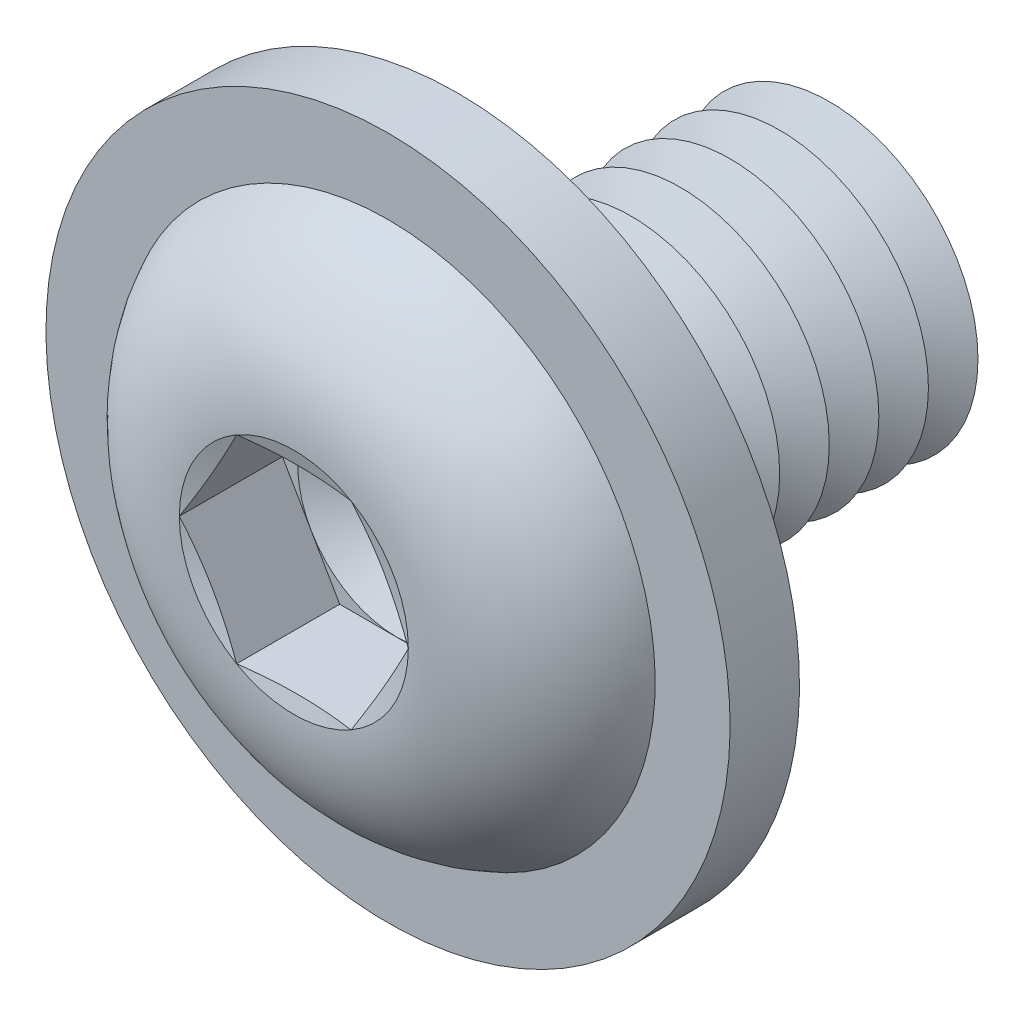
ISO-10303-21;
HEADER;
FILE_DESCRIPTION(('STEP AP214'),'2;1');
FILE_NAME('part.step','',(''),(''),'','','');
FILE_SCHEMA(('AUTOMOTIVE_DESIGN { 1 0 10303 214 1 1 1 1 }'));
ENDSEC;
DATA;
#1=APPLICATION_CONTEXT('core data for automotive mechanical design processes');
#2=APPLICATION_PROTOCOL_DEFINITION('international standard','automotive_design',2000,#1);
#3=PRODUCT_CONTEXT('',#1,'mechanical');
#4=PRODUCT('Part','Part','',(#3));
#5=PRODUCT_RELATED_PRODUCT_CATEGORY('part','',(#4));
#6=PRODUCT_DEFINITION_FORMATION('','',#4);
#7=PRODUCT_DEFINITION_CONTEXT('part definition',#1,'design');
#8=PRODUCT_DEFINITION('design','',#6,#7);
#9=PRODUCT_DEFINITION_SHAPE('','',#8);
#10=(LENGTH_UNIT() NAMED_UNIT(*) SI_UNIT(.MILLI.,.METRE.));
#11=(NAMED_UNIT(*) PLANE_ANGLE_UNIT() SI_UNIT($,.RADIAN.));
#12=(NAMED_UNIT(*) SI_UNIT($,.STERADIAN.) SOLID_ANGLE_UNIT());
#13=UNCERTAINTY_MEASURE_WITH_UNIT(LENGTH_MEASURE(1.E-05),#10,'distance_accuracy_value','');
#14=(GEOMETRIC_REPRESENTATION_CONTEXT(3) GLOBAL_UNCERTAINTY_ASSIGNED_CONTEXT((#13)) GLOBAL_UNIT_ASSIGNED_CONTEXT((#10,
#11,#12)) REPRESENTATION_CONTEXT('',''));
#15=CARTESIAN_POINT('',(0.,0.,0.));
#16=DIRECTION('',(0.,0.,1.));
#17=DIRECTION('',(1.,0.,0.));
#18=AXIS2_PLACEMENT_3D('',#15,#16,#17);
#19=CARTESIAN_POINT('',(0.,0.,-2.25));
#20=DIRECTION('',(0.,0.,1.));
#21=DIRECTION('',(1.,0.,0.));
#22=AXIS2_PLACEMENT_3D('',#19,#20,#21);
#23=CONICAL_SURFACE('',#22,1.5,1.0471975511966);
#24=CARTESIAN_POINT('',(0.,0.,-2.5));
#25=DIRECTION('',(0.,0.,1.));
#26=DIRECTION('',(1.,0.,0.));
#27=AXIS2_PLACEMENT_3D('',#24,#25,#26);
#28=CIRCLE('',#27,1.06698729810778);
#29=CARTESIAN_POINT('',(1.06698729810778,0.,-2.5));
#30=VERTEX_POINT('',#29);
#31=EDGE_CURVE('E274',#30,#30,#28,.T.);
#32=ORIENTED_EDGE('',*,*,#31,.T.);
#33=EDGE_LOOP('',(#32));
#34=FACE_BOUND('',#33,.T.);
#35=CARTESIAN_POINT('',(0.,0.,-2.25));
#36=DIRECTION('',(0.,0.,1.));
#37=DIRECTION('',(1.,0.,0.));
#38=AXIS2_PLACEMENT_3D('',#35,#36,#37);
#39=CIRCLE('',#38,1.5);
#40=CARTESIAN_POINT('',(1.5,0.,-2.25));
#41=VERTEX_POINT('',#40);
#42=EDGE_CURVE('E270',#41,#41,#39,.T.);
#43=ORIENTED_EDGE('',*,*,#42,.F.);
#44=EDGE_LOOP('',(#43));
#45=FACE_BOUND('',#44,.T.);
#46=ADVANCED_FACE('F39',(#34,#45),#23,.T.);
#47=CARTESIAN_POINT('',(0.,0.,-2.5));
#48=DIRECTION('',(0.,0.,-1.));
#49=DIRECTION('',(-1.,0.,0.));
#50=AXIS2_PLACEMENT_3D('',#47,#48,#49);
#51=CONICAL_SURFACE('',#50,1.06698729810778,1.0471975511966);
#52=CARTESIAN_POINT('',(0.,0.,-2.75));
#53=DIRECTION('',(0.,0.,1.));
#54=DIRECTION('',(1.,0.,0.));
#55=AXIS2_PLACEMENT_3D('',#52,#53,#54);
#56=CIRCLE('',#55,1.5);
#57=CARTESIAN_POINT('',(1.5,0.,-2.75));
#58=VERTEX_POINT('',#57);
#59=EDGE_CURVE('E278',#58,#58,#56,.T.);
#60=ORIENTED_EDGE('',*,*,#59,.T.);
#61=EDGE_LOOP('',(#60));
#62=FACE_BOUND('',#61,.T.);
#63=ORIENTED_EDGE('',*,*,#31,.F.);
#64=EDGE_LOOP('',(#63));
#65=FACE_BOUND('',#64,.T.);
#66=ADVANCED_FACE('F390',(#62,#65),#51,.T.);
#67=CARTESIAN_POINT('',(0.,1.5,-4.));
#68=DIRECTION('',(0.,0.,-1.));
#69=DIRECTION('',(-1.,0.,0.));
#70=AXIS2_PLACEMENT_3D('',#67,#68,#69);
#71=PLANE('',#70);
#72=CARTESIAN_POINT('',(0.,0.,-4.));
#73=DIRECTION('',(0.,0.,1.));
#74=DIRECTION('',(1.,0.,0.));
#75=AXIS2_PLACEMENT_3D('',#72,#73,#74);
#76=CIRCLE('',#75,1.06698729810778);
#77=CARTESIAN_POINT('',(1.06698729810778,0.,-4.));
#78=VERTEX_POINT('',#77);
#79=EDGE_CURVE('E297',#78,#78,#76,.T.);
#80=ORIENTED_EDGE('',*,*,#79,.F.);
#81=EDGE_LOOP('',(#80));
#82=FACE_BOUND('',#81,.T.);
#83=ADVANCED_FACE('F396',(#82),#71,.T.);
#84=CARTESIAN_POINT('',(0.,0.,-3.75));
#85=DIRECTION('',(0.,0.,1.));
#86=DIRECTION('',(1.,0.,0.));
#87=AXIS2_PLACEMENT_3D('',#84,#85,#86);
#88=CONICAL_SURFACE('',#87,1.5,1.0471975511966);
#89=ORIENTED_EDGE('',*,*,#79,.T.);
#90=EDGE_LOOP('',(#89));
#91=FACE_BOUND('',#90,.T.);
#92=CARTESIAN_POINT('',(0.,0.,-3.75));
#93=DIRECTION('',(0.,0.,1.));
#94=DIRECTION('',(1.,0.,0.));
#95=AXIS2_PLACEMENT_3D('',#92,#93,#94);
#96=CIRCLE('',#95,1.5);
#97=CARTESIAN_POINT('',(1.5,0.,-3.75));
#98=VERTEX_POINT('',#97);
#99=EDGE_CURVE('E293',#98,#98,#96,.T.);
#100=ORIENTED_EDGE('',*,*,#99,.F.);
#101=EDGE_LOOP('',(#100));
#102=FACE_BOUND('',#101,.T.);
#103=ADVANCED_FACE('F415',(#91,#102),#88,.T.);
#104=CARTESIAN_POINT('',(0.,0.,-3.5));
#105=DIRECTION('',(0.,0.,-1.));
#106=DIRECTION('',(-1.,0.,0.));
#107=AXIS2_PLACEMENT_3D('',#104,#105,#106);
#108=CONICAL_SURFACE('',#107,1.06698729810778,1.0471975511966);
#109=ORIENTED_EDGE('',*,*,#99,.T.);
#110=EDGE_LOOP('',(#109));
#111=FACE_BOUND('',#110,.T.);
#112=CARTESIAN_POINT('',(0.,0.,-3.5));
#113=DIRECTION('',(0.,0.,1.));
#114=DIRECTION('',(1.,0.,0.));
#115=AXIS2_PLACEMENT_3D('',#112,#113,#114);
#116=CIRCLE('',#115,1.06698729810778);
#117=CARTESIAN_POINT('',(1.06698729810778,0.,-3.5));
#118=VERTEX_POINT('',#117);
#119=EDGE_CURVE('E289',#118,#118,#116,.T.);
#120=ORIENTED_EDGE('',*,*,#119,.F.);
#121=EDGE_LOOP('',(#120));
#122=FACE_BOUND('',#121,.T.);
#123=ADVANCED_FACE('F412',(#111,#122),#108,.T.);
#124=CARTESIAN_POINT('',(0.,0.,-3.25));
#125=DIRECTION('',(0.,0.,1.));
#126=DIRECTION('',(1.,0.,0.));
#127=AXIS2_PLACEMENT_3D('',#124,#125,#126);
#128=CONICAL_SURFACE('',#127,1.5,1.0471975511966);
#129=ORIENTED_EDGE('',*,*,#119,.T.);
#130=EDGE_LOOP('',(#129));
#131=FACE_BOUND('',#130,.T.);
#132=CARTESIAN_POINT('',(0.,0.,-3.25));
#133=DIRECTION('',(0.,0.,1.));
#134=DIRECTION('',(1.,0.,0.));
#135=AXIS2_PLACEMENT_3D('',#132,#133,#134);
#136=CIRCLE('',#135,1.5);
#137=CARTESIAN_POINT('',(1.5,0.,-3.25));
#138=VERTEX_POINT('',#137);
#139=EDGE_CURVE('E285',#138,#138,#136,.T.);
#140=ORIENTED_EDGE('',*,*,#139,.F.);
#141=EDGE_LOOP('',(#140));
#142=FACE_BOUND('',#141,.T.);
#143=ADVANCED_FACE('F406',(#131,#142),#128,.T.);
#144=CARTESIAN_POINT('',(0.,0.,-3.));
#145=DIRECTION('',(0.,0.,-1.));
#146=DIRECTION('',(-1.,0.,0.));
#147=AXIS2_PLACEMENT_3D('',#144,#145,#146);
#148=CONICAL_SURFACE('',#147,1.06698729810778,1.0471975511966);
#149=ORIENTED_EDGE('',*,*,#139,.T.);
#150=EDGE_LOOP('',(#149));
#151=FACE_BOUND('',#150,.T.);
#152=CARTESIAN_POINT('',(0.,0.,-3.));
#153=DIRECTION('',(0.,0.,1.));
#154=DIRECTION('',(1.,0.,0.));
#155=AXIS2_PLACEMENT_3D('',#152,#153,#154);
#156=CIRCLE('',#155,1.06698729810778);
#157=CARTESIAN_POINT('',(1.06698729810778,0.,-3.));
#158=VERTEX_POINT('',#157);
#159=EDGE_CURVE('E281',#158,#158,#156,.T.);
#160=ORIENTED_EDGE('',*,*,#159,.F.);
#161=EDGE_LOOP('',(#160));
#162=FACE_BOUND('',#161,.T.);
#163=ADVANCED_FACE('F402',(#151,#162),#148,.T.);
#164=CARTESIAN_POINT('',(0.,0.,-2.75));
#165=DIRECTION('',(0.,0.,1.));
#166=DIRECTION('',(1.,0.,0.));
#167=AXIS2_PLACEMENT_3D('',#164,#165,#166);
#168=CONICAL_SURFACE('',#167,1.5,1.0471975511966);
#169=ORIENTED_EDGE('',*,*,#159,.T.);
#170=EDGE_LOOP('',(#169));
#171=FACE_BOUND('',#170,.T.);
#172=ORIENTED_EDGE('',*,*,#59,.F.);
#173=EDGE_LOOP('',(#172));
#174=FACE_BOUND('',#173,.T.);
#175=ADVANCED_FACE('F405',(#171,#174),#168,.T.);
#176=CARTESIAN_POINT('',(0.,0.,-1.75));
#177=DIRECTION('',(0.,0.,1.));
#178=DIRECTION('',(1.,0.,0.));
#179=AXIS2_PLACEMENT_3D('',#176,#177,#178);
#180=CONICAL_SURFACE('',#179,1.5,1.0471975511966);
#181=CARTESIAN_POINT('',(0.,0.,-2.));
#182=DIRECTION('',(0.,0.,1.));
#183=DIRECTION('',(1.,0.,0.));
#184=AXIS2_PLACEMENT_3D('',#181,#182,#183);
#185=CIRCLE('',#184,1.06698729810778);
#186=CARTESIAN_POINT('',(1.06698729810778,0.,-2.));
#187=VERTEX_POINT('',#186);
#188=EDGE_CURVE('E266',#187,#187,#185,.T.);
#189=ORIENTED_EDGE('',*,*,#188,.T.);
#190=EDGE_LOOP('',(#189));
#191=FACE_BOUND('',#190,.T.);
#192=CARTESIAN_POINT('',(0.,0.,-1.75));
#193=DIRECTION('',(0.,0.,1.));
#194=DIRECTION('',(1.,0.,0.));
#195=AXIS2_PLACEMENT_3D('',#192,#193,#194);
#196=CIRCLE('',#195,1.5);
#197=CARTESIAN_POINT('',(1.5,0.,-1.75));
#198=VERTEX_POINT('',#197);
#199=EDGE_CURVE('E262',#198,#198,#196,.T.);
#200=ORIENTED_EDGE('',*,*,#199,.F.);
#201=EDGE_LOOP('',(#200));
#202=FACE_BOUND('',#201,.T.);
#203=ADVANCED_FACE('F410',(#191,#202),#180,.T.);
#204=CARTESIAN_POINT('',(0.,0.,-2.));
#205=DIRECTION('',(0.,0.,-1.));
#206=DIRECTION('',(-1.,0.,0.));
#207=AXIS2_PLACEMENT_3D('',#204,#205,#206);
#208=CONICAL_SURFACE('',#207,1.06698729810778,1.0471975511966);
#209=ORIENTED_EDGE('',*,*,#42,.T.);
#210=EDGE_LOOP('',(#209));
#211=FACE_BOUND('',#210,.T.);
#212=ORIENTED_EDGE('',*,*,#188,.F.);
#213=EDGE_LOOP('',(#212));
#214=FACE_BOUND('',#213,.T.);
#215=ADVANCED_FACE('F461',(#211,#214),#208,.T.);
#216=CARTESIAN_POINT('',(0.,0.,-1.25));
#217=DIRECTION('',(0.,0.,1.));
#218=DIRECTION('',(1.,0.,0.));
#219=AXIS2_PLACEMENT_3D('',#216,#217,#218);
#220=CONICAL_SURFACE('',#219,1.5,1.0471975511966);
#221=CARTESIAN_POINT('',(0.,0.,-1.5));
#222=DIRECTION('',(0.,0.,1.));
#223=DIRECTION('',(1.,0.,0.));
#224=AXIS2_PLACEMENT_3D('',#221,#222,#223);
#225=CIRCLE('',#224,1.06698729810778);
#226=CARTESIAN_POINT('',(1.06698729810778,0.,-1.5));
#227=VERTEX_POINT('',#226);
#228=EDGE_CURVE('E258',#227,#227,#225,.T.);
#229=ORIENTED_EDGE('',*,*,#228,.T.);
#230=EDGE_LOOP('',(#229));
#231=FACE_BOUND('',#230,.T.);
#232=CARTESIAN_POINT('',(0.,0.,-1.25));
#233=DIRECTION('',(0.,0.,1.));
#234=DIRECTION('',(1.,0.,0.));
#235=AXIS2_PLACEMENT_3D('',#232,#233,#234);
#236=CIRCLE('',#235,1.5);
#237=CARTESIAN_POINT('',(1.5,0.,-1.25));
#238=VERTEX_POINT('',#237);
#239=EDGE_CURVE('E254',#238,#238,#236,.T.);
#240=ORIENTED_EDGE('',*,*,#239,.F.);
#241=EDGE_LOOP('',(#240));
#242=FACE_BOUND('',#241,.T.);
#243=ADVANCED_FACE('F467',(#231,#242),#220,.T.);
#244=CARTESIAN_POINT('',(0.,0.,-1.5));
#245=DIRECTION('',(0.,0.,-1.));
#246=DIRECTION('',(-1.,0.,0.));
#247=AXIS2_PLACEMENT_3D('',#244,#245,#246);
#248=CONICAL_SURFACE('',#247,1.06698729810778,1.0471975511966);
#249=ORIENTED_EDGE('',*,*,#199,.T.);
#250=EDGE_LOOP('',(#249));
#251=FACE_BOUND('',#250,.T.);
#252=ORIENTED_EDGE('',*,*,#228,.F.);
#253=EDGE_LOOP('',(#252));
#254=FACE_BOUND('',#253,.T.);
#255=ADVANCED_FACE('F474',(#251,#254),#248,.T.);
#256=CARTESIAN_POINT('',(0.,0.,-0.749999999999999));
#257=DIRECTION('',(0.,0.,1.));
#258=DIRECTION('',(1.,0.,0.));
#259=AXIS2_PLACEMENT_3D('',#256,#257,#258);
#260=CONICAL_SURFACE('',#259,1.5,1.0471975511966);
#261=CARTESIAN_POINT('',(0.,0.,-0.999999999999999));
#262=DIRECTION('',(0.,0.,1.));
#263=DIRECTION('',(1.,0.,0.));
#264=AXIS2_PLACEMENT_3D('',#261,#262,#263);
#265=CIRCLE('',#264,1.06698729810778);
#266=CARTESIAN_POINT('',(1.06698729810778,0.,-0.999999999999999));
#267=VERTEX_POINT('',#266);
#268=EDGE_CURVE('E250',#267,#267,#265,.T.);
#269=ORIENTED_EDGE('',*,*,#268,.T.);
#270=EDGE_LOOP('',(#269));
#271=FACE_BOUND('',#270,.T.);
#272=CARTESIAN_POINT('',(0.,0.,-0.749999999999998));
#273=DIRECTION('',(0.,0.,1.));
#274=DIRECTION('',(1.,0.,0.));
#275=AXIS2_PLACEMENT_3D('',#272,#273,#274);
#276=CIRCLE('',#275,1.5);
#277=CARTESIAN_POINT('',(1.5,0.,-0.749999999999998));
#278=VERTEX_POINT('',#277);
#279=EDGE_CURVE('E242',#278,#278,#276,.T.);
#280=ORIENTED_EDGE('',*,*,#279,.F.);
#281=EDGE_LOOP('',(#280));
#282=FACE_BOUND('',#281,.T.);
#283=ADVANCED_FACE('F481',(#271,#282),#260,.T.);
#284=CARTESIAN_POINT('',(0.,0.,-0.999999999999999));
#285=DIRECTION('',(0.,0.,-1.));
#286=DIRECTION('',(-1.,0.,0.));
#287=AXIS2_PLACEMENT_3D('',#284,#285,#286);
#288=CONICAL_SURFACE('',#287,1.06698729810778,1.0471975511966);
#289=ORIENTED_EDGE('',*,*,#239,.T.);
#290=EDGE_LOOP('',(#289));
#291=FACE_BOUND('',#290,.T.);
#292=ORIENTED_EDGE('',*,*,#268,.F.);
#293=EDGE_LOOP('',(#292));
#294=FACE_BOUND('',#293,.T.);
#295=ADVANCED_FACE('F488',(#291,#294),#288,.T.);
#296=CARTESIAN_POINT('',(0.,0.,-0.249999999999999));
#297=DIRECTION('',(0.,0.,1.));
#298=DIRECTION('',(1.,0.,0.));
#299=AXIS2_PLACEMENT_3D('',#296,#297,#298);
#300=CONICAL_SURFACE('',#299,1.5,1.0471975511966);
#301=CARTESIAN_POINT('',(0.,0.,-0.499999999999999));
#302=DIRECTION('',(0.,0.,1.));
#303=DIRECTION('',(1.,0.,0.));
#304=AXIS2_PLACEMENT_3D('',#301,#302,#303);
#305=CIRCLE('',#304,1.06698729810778);
#306=CARTESIAN_POINT('',(1.06698729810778,0.,-0.499999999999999));
#307=VERTEX_POINT('',#306);
#308=EDGE_CURVE('E231',#307,#307,#305,.T.);
#309=ORIENTED_EDGE('',*,*,#308,.T.);
#310=EDGE_LOOP('',(#309));
#311=FACE_BOUND('',#310,.T.);
#312=CARTESIAN_POINT('',(0.,0.,-0.249999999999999));
#313=DIRECTION('',(0.,0.,1.));
#314=DIRECTION('',(1.,0.,0.));
#315=AXIS2_PLACEMENT_3D('',#312,#313,#314);
#316=CIRCLE('',#315,1.5);
#317=CARTESIAN_POINT('',(1.5,0.,-0.249999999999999));
#318=VERTEX_POINT('',#317);
#319=EDGE_CURVE('E246',#318,#318,#316,.T.);
#320=ORIENTED_EDGE('',*,*,#319,.F.);
#321=EDGE_LOOP('',(#320));
#322=FACE_BOUND('',#321,.T.);
#323=ADVANCED_FACE('F495',(#311,#322),#300,.T.);
#324=CARTESIAN_POINT('',(0.,0.,-0.499999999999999));
#325=DIRECTION('',(0.,0.,-1.));
#326=DIRECTION('',(-1.,0.,0.));
#327=AXIS2_PLACEMENT_3D('',#324,#325,#326);
#328=CONICAL_SURFACE('',#327,1.06698729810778,1.0471975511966);
#329=ORIENTED_EDGE('',*,*,#279,.T.);
#330=EDGE_LOOP('',(#329));
#331=FACE_BOUND('',#330,.T.);
#332=ORIENTED_EDGE('',*,*,#308,.F.);
#333=EDGE_LOOP('',(#332));
#334=FACE_BOUND('',#333,.T.);
#335=ADVANCED_FACE('F220',(#331,#334),#328,.T.);
#336=CARTESIAN_POINT('',(0.,1.5,0.));
#337=DIRECTION('',(0.,0.,-1.));
#338=DIRECTION('',(-1.,0.,0.));
#339=AXIS2_PLACEMENT_3D('',#336,#337,#338);
#340=PLANE('',#339);
#341=CARTESIAN_POINT('',(0.,0.,0.));
#342=DIRECTION('',(0.,0.,-1.));
#343=DIRECTION('',(-1.,0.,0.));
#344=AXIS2_PLACEMENT_3D('',#341,#342,#343);
#345=CIRCLE('',#344,1.75);
#346=CARTESIAN_POINT('',(-1.75,0.,0.));
#347=VERTEX_POINT('',#346);
#348=EDGE_CURVE('E306',#347,#347,#345,.F.);
#349=ORIENTED_EDGE('',*,*,#348,.T.);
#350=EDGE_LOOP('',(#349));
#351=FACE_BOUND('',#350,.T.);
#352=CARTESIAN_POINT('',(0.,0.,0.));
#353=DIRECTION('',(0.,0.,-1.));
#354=DIRECTION('',(0.,1.,0.));
#355=AXIS2_PLACEMENT_3D('',#352,#353,#354);
#356=CIRCLE('',#355,3.45);
#357=CARTESIAN_POINT('',(0.,3.45,0.));
#358=VERTEX_POINT('',#357);
#359=EDGE_CURVE('E791',#358,#358,#356,.T.);
#360=ORIENTED_EDGE('',*,*,#359,.T.);
#361=EDGE_LOOP('',(#360));
#362=FACE_BOUND('',#361,.T.);
#363=ADVANCED_FACE('F507',(#351,#362),#340,.T.);
#364=CARTESIAN_POINT('',(0.,0.,-0.25));
#365=DIRECTION('',(0.,0.,-1.));
#366=DIRECTION('',(-1.,0.,0.));
#367=AXIS2_PLACEMENT_3D('',#364,#365,#366);
#368=TOROIDAL_SURFACE('',#367,1.75,0.25);
#369=ORIENTED_EDGE('',*,*,#348,.F.);
#370=EDGE_LOOP('',(#369));
#371=FACE_BOUND('',#370,.T.);
#372=ORIENTED_EDGE('',*,*,#319,.T.);
#373=EDGE_LOOP('',(#372));
#374=FACE_BOUND('',#373,.T.);
#375=ADVANCED_FACE('F41',(#371,#374),#368,.F.);
#376=CARTESIAN_POINT('',(0.,0.,0.7));
#377=DIRECTION('',(0.,0.,-1.));
#378=DIRECTION('',(0.,1.,0.));
#379=AXIS2_PLACEMENT_3D('',#376,#377,#378);
#380=CYLINDRICAL_SURFACE('',#379,3.45);
#381=CARTESIAN_POINT('',(0.,0.,0.7));
#382=DIRECTION('',(0.,0.,-1.));
#383=DIRECTION('',(0.,1.,0.));
#384=AXIS2_PLACEMENT_3D('',#381,#382,#383);
#385=CIRCLE('',#384,3.45);
#386=CARTESIAN_POINT('',(0.,3.45,0.7));
#387=VERTEX_POINT('',#386);
#388=EDGE_CURVE('E789',#387,#387,#385,.T.);
#389=ORIENTED_EDGE('',*,*,#388,.T.);
#390=EDGE_LOOP('',(#389));
#391=FACE_BOUND('',#390,.T.);
#392=ORIENTED_EDGE('',*,*,#359,.F.);
#393=EDGE_LOOP('',(#392));
#394=FACE_BOUND('',#393,.T.);
#395=ADVANCED_FACE('F518',(#391,#394),#380,.T.);
#396=CARTESIAN_POINT('',(0.,0.,0.7));
#397=DIRECTION('',(0.,0.,-1.));
#398=DIRECTION('',(0.,1.,0.));
#399=AXIS2_PLACEMENT_3D('',#396,#397,#398);
#400=PLANE('',#399);
#401=CARTESIAN_POINT('',(0.,0.,0.7));
#402=DIRECTION('',(0.,0.,-1.));
#403=DIRECTION('',(0.,1.,0.));
#404=AXIS2_PLACEMENT_3D('',#401,#402,#403);
#405=CIRCLE('',#404,2.69421838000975);
#406=CARTESIAN_POINT('',(0.,2.69421838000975,0.7));
#407=VERTEX_POINT('',#406);
#408=EDGE_CURVE('E43',#407,#407,#405,.F.);
#409=ORIENTED_EDGE('',*,*,#408,.F.);
#410=EDGE_LOOP('',(#409));
#411=FACE_BOUND('',#410,.T.);
#412=ORIENTED_EDGE('',*,*,#388,.F.);
#413=EDGE_LOOP('',(#412));
#414=FACE_BOUND('',#413,.T.);
#415=ADVANCED_FACE('F117',(#411,#414),#400,.F.);
#416=CARTESIAN_POINT('',(0.,0.,0.609999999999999));
#417=DIRECTION('',(0.,0.,1.));
#418=DIRECTION('',(1.,0.,0.));
#419=AXIS2_PLACEMENT_3D('',#416,#417,#418);
#420=CONICAL_SURFACE('',#419,0.99999953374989,1.0471975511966);
#421=CARTESIAN_POINT('',(0.,0.,0.0326500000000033));
#422=VERTEX_POINT('',#421);
#423=VERTEX_LOOP('',#422);
#424=FACE_BOUND('',#423,.T.);
#425=CARTESIAN_POINT('',(0.,0.,0.609999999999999));
#426=DIRECTION('',(0.,0.,1.));
#427=DIRECTION('',(1.,0.,0.));
#428=AXIS2_PLACEMENT_3D('',#425,#426,#427);
#429=CIRCLE('',#428,0.99999953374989);
#430=CARTESIAN_POINT('',(0.866024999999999,0.499999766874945,0.609999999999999));
#431=VERTEX_POINT('',#430);
#432=CARTESIAN_POINT('',(0.,0.99999953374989,0.609999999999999));
#433=VERTEX_POINT('',#432);
#434=EDGE_CURVE('E120',#431,#433,#429,.T.);
#435=ORIENTED_EDGE('',*,*,#434,.T.);
#436=CARTESIAN_POINT('',(0.,0.,0.609999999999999));
#437=DIRECTION('',(0.,0.,1.));
#438=DIRECTION('',(1.,0.,0.));
#439=AXIS2_PLACEMENT_3D('',#436,#437,#438);
#440=CIRCLE('',#439,0.99999953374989);
#441=CARTESIAN_POINT('',(-0.866024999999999,0.499999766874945,0.609999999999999));
#442=VERTEX_POINT('',#441);
#443=EDGE_CURVE('E11',#433,#442,#440,.T.);
#444=ORIENTED_EDGE('',*,*,#443,.T.);
#445=CARTESIAN_POINT('',(-0.866024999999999,-0.499999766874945,0.609999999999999));
#446=VERTEX_POINT('',#445);
#447=EDGE_CURVE('E49',#442,#446,#440,.T.);
#448=ORIENTED_EDGE('',*,*,#447,.T.);
#449=CARTESIAN_POINT('',(0.,-0.99999953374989,0.609999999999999));
#450=VERTEX_POINT('',#449);
#451=EDGE_CURVE('E312',#446,#450,#440,.T.);
#452=ORIENTED_EDGE('',*,*,#451,.T.);
#453=CARTESIAN_POINT('',(0.866024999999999,-0.499999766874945,0.609999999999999));
#454=VERTEX_POINT('',#453);
#455=EDGE_CURVE('E57',#450,#454,#440,.T.);
#456=ORIENTED_EDGE('',*,*,#455,.T.);
#457=EDGE_CURVE('E50',#454,#431,#440,.T.);
#458=ORIENTED_EDGE('',*,*,#457,.T.);
#459=EDGE_LOOP('',(#435,#444,#448,#452,#456,#458));
#460=FACE_BOUND('',#459,.T.);
#461=ADVANCED_FACE('F114',(#424,#460),#420,.F.);
#462=CARTESIAN_POINT('',(0.,0.,0.609999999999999));
#463=DIRECTION('',(0.,0.,1.));
#464=DIRECTION('',(1.,0.,0.));
#465=AXIS2_PLACEMENT_3D('',#462,#463,#464);
#466=PLANE('',#465);
#467=ORIENTED_EDGE('',*,*,#451,.F.);
#468=DIRECTION('',(0.5,-0.866025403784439,0.));
#469=VECTOR('',#468,1.);
#470=CARTESIAN_POINT('',(-1.1547,0.,0.609999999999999));
#471=LINE('',#470,#469);
#472=CARTESIAN_POINT('',(-0.577349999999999,-0.99999953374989,0.609999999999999));
#473=VERTEX_POINT('',#472);
#474=EDGE_CURVE('E154',#446,#473,#471,.T.);
#475=ORIENTED_EDGE('',*,*,#474,.T.);
#476=DIRECTION('',(1.,0.,0.));
#477=VECTOR('',#476,1.);
#478=CARTESIAN_POINT('',(-0.577349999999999,-0.99999953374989,0.609999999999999));
#479=LINE('',#478,#477);
#480=EDGE_CURVE('E160',#473,#450,#479,.T.);
#481=ORIENTED_EDGE('',*,*,#480,.T.);
#482=EDGE_LOOP('',(#467,#475,#481));
#483=FACE_BOUND('',#482,.T.);
#484=ADVANCED_FACE('F116',(#483),#466,.T.);
#485=ORIENTED_EDGE('',*,*,#455,.F.);
#486=CARTESIAN_POINT('',(0.577349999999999,-0.99999953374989,0.609999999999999));
#487=VERTEX_POINT('',#486);
#488=EDGE_CURVE('E159',#450,#487,#479,.T.);
#489=ORIENTED_EDGE('',*,*,#488,.T.);
#490=DIRECTION('',(0.5,0.866025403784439,0.));
#491=VECTOR('',#490,1.);
#492=CARTESIAN_POINT('',(0.577349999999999,-0.99999953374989,0.609999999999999));
#493=LINE('',#492,#491);
#494=EDGE_CURVE('E165',#487,#454,#493,.T.);
#495=ORIENTED_EDGE('',*,*,#494,.T.);
#496=EDGE_LOOP('',(#485,#489,#495));
#497=FACE_BOUND('',#496,.T.);
#498=ADVANCED_FACE('F539',(#497),#466,.T.);
#499=ORIENTED_EDGE('',*,*,#457,.F.);
#500=CARTESIAN_POINT('',(1.1547,0.,0.609999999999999));
#501=VERTEX_POINT('',#500);
#502=EDGE_CURVE('E164',#454,#501,#493,.T.);
#503=ORIENTED_EDGE('',*,*,#502,.T.);
#504=DIRECTION('',(-0.5,0.866025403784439,0.));
#505=VECTOR('',#504,1.);
#506=CARTESIAN_POINT('',(1.1547,0.,0.609999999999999));
#507=LINE('',#506,#505);
#508=EDGE_CURVE('E142',#501,#431,#507,.T.);
#509=ORIENTED_EDGE('',*,*,#508,.T.);
#510=EDGE_LOOP('',(#499,#503,#509));
#511=FACE_BOUND('',#510,.T.);
#512=ADVANCED_FACE('F544',(#511),#466,.T.);
#513=ORIENTED_EDGE('',*,*,#434,.F.);
#514=CARTESIAN_POINT('',(0.577349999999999,0.99999953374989,0.609999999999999));
#515=VERTEX_POINT('',#514);
#516=EDGE_CURVE('E127',#431,#515,#507,.T.);
#517=ORIENTED_EDGE('',*,*,#516,.T.);
#518=DIRECTION('',(-1.,0.,0.));
#519=VECTOR('',#518,1.);
#520=CARTESIAN_POINT('',(0.577349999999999,0.99999953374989,0.609999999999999));
#521=LINE('',#520,#519);
#522=EDGE_CURVE('E138',#515,#433,#521,.T.);
#523=ORIENTED_EDGE('',*,*,#522,.T.);
#524=EDGE_LOOP('',(#513,#517,#523));
#525=FACE_BOUND('',#524,.T.);
#526=ADVANCED_FACE('F144',(#525),#466,.T.);
#527=ORIENTED_EDGE('',*,*,#443,.F.);
#528=CARTESIAN_POINT('',(-0.577350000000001,0.999999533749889,0.609999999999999));
#529=VERTEX_POINT('',#528);
#530=EDGE_CURVE('E133',#433,#529,#521,.T.);
#531=ORIENTED_EDGE('',*,*,#530,.T.);
#532=DIRECTION('',(-0.5,-0.866025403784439,0.));
#533=VECTOR('',#532,1.);
#534=CARTESIAN_POINT('',(-0.577350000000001,0.999999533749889,0.609999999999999));
#535=LINE('',#534,#533);
#536=EDGE_CURVE('E136',#529,#442,#535,.T.);
#537=ORIENTED_EDGE('',*,*,#536,.T.);
#538=EDGE_LOOP('',(#527,#531,#537));
#539=FACE_BOUND('',#538,.T.);
#540=ADVANCED_FACE('F132',(#539),#466,.T.);
#541=ORIENTED_EDGE('',*,*,#447,.F.);
#542=CARTESIAN_POINT('',(-1.1547,0.,0.609999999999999));
#543=VERTEX_POINT('',#542);
#544=EDGE_CURVE('E146',#442,#543,#535,.T.);
#545=ORIENTED_EDGE('',*,*,#544,.T.);
#546=EDGE_CURVE('E155',#543,#446,#471,.T.);
#547=ORIENTED_EDGE('',*,*,#546,.T.);
#548=EDGE_LOOP('',(#541,#545,#547));
#549=FACE_BOUND('',#548,.T.);
#550=ADVANCED_FACE('F329',(#549),#466,.T.);
#551=CARTESIAN_POINT('',(-1.1547,0.,0.609999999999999));
#552=DIRECTION('',(-0.866025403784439,-0.5,0.));
#553=DIRECTION('',(0.5,-0.866025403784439,0.));
#554=AXIS2_PLACEMENT_3D('',#551,#552,#553);
#555=PLANE('',#554);
#556=CARTESIAN_POINT('',(-1.15481547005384,0.000200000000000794,1.65003094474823));
#557=CARTESIAN_POINT('',(-1.13083002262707,-0.0413440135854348,1.64359970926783));
#558=CARTESIAN_POINT('',(-1.10680107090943,-0.0829633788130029,1.63776108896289));
#559=CARTESIAN_POINT('',(-1.05865826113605,-0.166349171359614,1.62750303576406));
#560=CARTESIAN_POINT('',(-1.03454437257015,-0.208115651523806,1.62308418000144));
#561=CARTESIAN_POINT('',(-0.986377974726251,-0.291542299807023,1.61592375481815));
#562=CARTESIAN_POINT('',(-0.962325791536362,-0.333201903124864,1.61317364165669));
#563=CARTESIAN_POINT('',(-0.914190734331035,-0.416574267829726,1.60948600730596));
#564=CARTESIAN_POINT('',(-0.890107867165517,-0.458287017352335,1.60854813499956));
#565=CARTESIAN_POINT('',(-0.841942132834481,-0.541712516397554,1.60854813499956));
#566=CARTESIAN_POINT('',(-0.817859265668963,-0.583425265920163,1.60948600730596));
#567=CARTESIAN_POINT('',(-0.769724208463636,-0.666797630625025,1.61317364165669));
#568=CARTESIAN_POINT('',(-0.745672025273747,-0.708457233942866,1.61592375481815));
#569=CARTESIAN_POINT('',(-0.697505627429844,-0.791883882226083,1.62308418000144));
#570=CARTESIAN_POINT('',(-0.673391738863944,-0.833650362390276,1.62750303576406));
#571=CARTESIAN_POINT('',(-0.625248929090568,-0.917036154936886,1.63776108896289));
#572=CARTESIAN_POINT('',(-0.60121997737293,-0.958655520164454,1.64359970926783));
#573=CARTESIAN_POINT('',(-0.577234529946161,-1.00019953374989,1.65003094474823));
#574=B_SPLINE_CURVE_WITH_KNOTS('',3,(#556,#557,#558,#559,#560,#561,#562,#563,#564,#565,#566,
#567,#568,#569,#570,#571,#572,#573),.UNSPECIFIED.,.F.,.F.,(4,2,2,2,2,2,2,2,4),(0.,
0.145207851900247,0.290474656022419,0.434991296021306,0.579479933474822,0.723968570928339,
0.868485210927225,1.0137520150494,1.15895986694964),.UNSPECIFIED.);
#575=CARTESIAN_POINT('',(-1.1547,0.,1.65));
#576=VERTEX_POINT('',#575);
#577=CARTESIAN_POINT('',(-0.577349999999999,-0.99999953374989,1.65));
#578=VERTEX_POINT('',#577);
#579=EDGE_CURVE('E334',#576,#578,#574,.T.);
#580=ORIENTED_EDGE('',*,*,#579,.T.);
#581=DIRECTION('',(0.,0.,1.));
#582=VECTOR('',#581,1.);
#583=CARTESIAN_POINT('',(-0.577349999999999,-0.99999953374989,0.609999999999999));
#584=LINE('',#583,#582);
#585=EDGE_CURVE('E178',#473,#578,#584,.T.);
#586=ORIENTED_EDGE('',*,*,#585,.F.);
#587=ORIENTED_EDGE('',*,*,#474,.F.);
#588=ORIENTED_EDGE('',*,*,#546,.F.);
#589=DIRECTION('',(0.,0.,1.));
#590=VECTOR('',#589,1.);
#591=CARTESIAN_POINT('',(-1.1547,0.,0.609999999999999));
#592=LINE('',#591,#590);
#593=EDGE_CURVE('E182',#543,#576,#592,.T.);
#594=ORIENTED_EDGE('',*,*,#593,.T.);
#595=EDGE_LOOP('',(#580,#586,#587,#588,#594));
#596=FACE_BOUND('',#595,.T.);
#597=ADVANCED_FACE('F327',(#596),#555,.F.);
#598=CARTESIAN_POINT('',(-0.577349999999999,-0.99999953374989,0.609999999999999));
#599=DIRECTION('',(0.,-1.,0.));
#600=DIRECTION('',(0.,0.,-1.));
#601=AXIS2_PLACEMENT_3D('',#598,#599,#600);
#602=PLANE('',#601);
#603=CARTESIAN_POINT('',(-1.7425668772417,-0.99999953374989,1.87893949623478));
#604=CARTESIAN_POINT('',(-1.65819693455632,-0.99999953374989,1.85935934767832));
#605=CARTESIAN_POINT('',(-1.57375647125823,-0.99999953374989,1.84006351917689));
#606=CARTESIAN_POINT('',(-1.40464514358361,-0.99999953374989,1.80242908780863));
#607=CARTESIAN_POINT('',(-1.31997423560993,-0.99999953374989,1.78409068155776));
#608=CARTESIAN_POINT('',(-1.14955192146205,-0.99999953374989,1.74860242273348));
#609=CARTESIAN_POINT('',(-1.06379782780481,-0.99999953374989,1.73146532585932));
#610=CARTESIAN_POINT('',(-0.891887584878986,-0.99999953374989,1.69925819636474));
#611=CARTESIAN_POINT('',(-0.805731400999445,-0.99999953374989,1.68418834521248));
#612=CARTESIAN_POINT('',(-0.635256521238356,-0.99999953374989,1.65751615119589));
#613=CARTESIAN_POINT('',(-0.550951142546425,-0.99999953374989,1.64583105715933));
#614=CARTESIAN_POINT('',(-0.381865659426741,-0.99999953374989,1.62668811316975));
#615=CARTESIAN_POINT('',(-0.297085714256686,-0.99999953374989,1.61922892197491));
#616=CARTESIAN_POINT('',(-0.127577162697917,-0.99999953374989,1.60981453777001));
#617=CARTESIAN_POINT('',(-0.0428499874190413,-0.99999953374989,1.60783514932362));
#618=CARTESIAN_POINT('',(0.126542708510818,-0.99999953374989,1.60973012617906));
#619=CARTESIAN_POINT('',(0.211208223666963,-0.99999953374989,1.61360496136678));
#620=CARTESIAN_POINT('',(0.356115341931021,-0.99999953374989,1.62460226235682));
#621=CARTESIAN_POINT('',(0.416458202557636,-0.99999953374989,1.63048841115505));
#622=CARTESIAN_POINT('',(0.536893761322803,-0.99999953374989,1.64437752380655));
#623=CARTESIAN_POINT('',(0.596986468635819,-0.99999953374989,1.65238040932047));
#624=CARTESIAN_POINT('',(0.777275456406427,-0.99999953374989,1.67888855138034));
#625=CARTESIAN_POINT('',(0.897104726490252,-0.99999953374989,1.69985858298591));
#626=CARTESIAN_POINT('',(1.07751611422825,-0.99999953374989,1.73433574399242));
#627=CARTESIAN_POINT('',(1.1383777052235,-0.99999953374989,1.74646914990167));
#628=CARTESIAN_POINT('',(1.25994955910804,-0.99999953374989,1.7714845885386));
#629=CARTESIAN_POINT('',(1.32065982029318,-0.99999953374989,1.7843666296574));
#630=CARTESIAN_POINT('',(1.44162663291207,-0.99999953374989,1.81062164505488));
#631=CARTESIAN_POINT('',(1.50188385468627,-0.99999953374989,1.82399156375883));
#632=CARTESIAN_POINT('',(1.62229550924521,-0.99999953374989,1.85116781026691));
#633=CARTESIAN_POINT('',(1.68244994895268,-0.99999953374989,1.86497410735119));
#634=CARTESIAN_POINT('',(1.7425668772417,-0.99999953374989,1.87893949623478));
#635=B_SPLINE_CURVE_WITH_KNOTS('',3,(#603,#604,#605,#606,#607,#608,#609,#610,#611,#612,#613,
#614,#615,#616,#617,#618,#619,#620,#621,#622,#623,#624,#625,#626,#627,#628,#629,#630,#631,#632,
#633,#634),.UNSPECIFIED.,.F.,.F.,(4,2,2,2,2,2,2,2,2,2,2,2,2,2,2,4),(0.,0.259842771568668,
0.519738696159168,0.782071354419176,1.04442702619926,1.29968778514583,1.55486748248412,
1.80891865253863,2.06299021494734,2.24483732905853,2.42667771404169,2.79149503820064,
2.97767344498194,3.16385393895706,3.34902052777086,3.53417411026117),.UNSPECIFIED.);
#636=CARTESIAN_POINT('',(0.577349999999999,-0.99999953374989,1.65));
#637=VERTEX_POINT('',#636);
#638=EDGE_CURVE('E341',#578,#637,#635,.T.);
#639=ORIENTED_EDGE('',*,*,#638,.T.);
#640=DIRECTION('',(0.,0.,1.));
#641=VECTOR('',#640,1.);
#642=CARTESIAN_POINT('',(0.577349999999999,-0.99999953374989,0.609999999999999));
#643=LINE('',#642,#641);
#644=EDGE_CURVE('E174',#487,#637,#643,.T.);
#645=ORIENTED_EDGE('',*,*,#644,.F.);
#646=ORIENTED_EDGE('',*,*,#488,.F.);
#647=ORIENTED_EDGE('',*,*,#480,.F.);
#648=ORIENTED_EDGE('',*,*,#585,.T.);
#649=EDGE_LOOP('',(#639,#645,#646,#647,#648));
#650=FACE_BOUND('',#649,.T.);
#651=ADVANCED_FACE('F379',(#650),#602,.F.);
#652=CARTESIAN_POINT('',(0.577349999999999,-0.99999953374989,0.609999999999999));
#653=DIRECTION('',(0.866025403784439,-0.5,0.));
#654=DIRECTION('',(0.5,0.866025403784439,0.));
#655=AXIS2_PLACEMENT_3D('',#652,#653,#654);
#656=PLANE('',#655);
#657=CARTESIAN_POINT('',(0.577234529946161,-1.00019953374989,1.65003094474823));
#658=CARTESIAN_POINT('',(0.601219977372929,-0.958655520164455,1.64359970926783));
#659=CARTESIAN_POINT('',(0.625248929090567,-0.917036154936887,1.63776108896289));
#660=CARTESIAN_POINT('',(0.673391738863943,-0.833650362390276,1.62750303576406));
#661=CARTESIAN_POINT('',(0.697505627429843,-0.791883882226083,1.62308418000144));
#662=CARTESIAN_POINT('',(0.745672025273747,-0.708457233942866,1.61592375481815));
#663=CARTESIAN_POINT('',(0.769724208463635,-0.666797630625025,1.61317364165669));
#664=CARTESIAN_POINT('',(0.817859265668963,-0.583425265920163,1.60948600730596));
#665=CARTESIAN_POINT('',(0.841942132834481,-0.541712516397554,1.60854813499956));
#666=CARTESIAN_POINT('',(0.890107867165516,-0.458287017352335,1.60854813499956));
#667=CARTESIAN_POINT('',(0.914190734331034,-0.416574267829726,1.60948600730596));
#668=CARTESIAN_POINT('',(0.962325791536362,-0.333201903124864,1.61317364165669));
#669=CARTESIAN_POINT('',(0.986377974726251,-0.291542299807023,1.61592375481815));
#670=CARTESIAN_POINT('',(1.03454437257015,-0.208115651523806,1.62308418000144));
#671=CARTESIAN_POINT('',(1.05865826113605,-0.166349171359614,1.62750303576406));
#672=CARTESIAN_POINT('',(1.10680107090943,-0.0829633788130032,1.63776108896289));
#673=CARTESIAN_POINT('',(1.13083002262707,-0.0413440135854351,1.64359970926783));
#674=CARTESIAN_POINT('',(1.15481547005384,0.0002000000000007,1.65003094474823));
#675=B_SPLINE_CURVE_WITH_KNOTS('',3,(#657,#658,#659,#660,#661,#662,#663,#664,#665,#666,#667,
#668,#669,#670,#671,#672,#673,#674),.UNSPECIFIED.,.F.,.F.,(4,2,2,2,2,2,2,2,4),(0.,
0.145207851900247,0.290474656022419,0.434991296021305,0.579479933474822,0.723968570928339,
0.868485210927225,1.0137520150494,1.15895986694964),.UNSPECIFIED.);
#676=CARTESIAN_POINT('',(1.1547,0.,1.65));
#677=VERTEX_POINT('',#676);
#678=EDGE_CURVE('E232',#637,#677,#675,.T.);
#679=ORIENTED_EDGE('',*,*,#678,.T.);
#680=DIRECTION('',(0.,0.,1.));
#681=VECTOR('',#680,1.);
#682=CARTESIAN_POINT('',(1.1547,0.,0.609999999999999));
#683=LINE('',#682,#681);
#684=EDGE_CURVE('E169',#501,#677,#683,.T.);
#685=ORIENTED_EDGE('',*,*,#684,.F.);
#686=ORIENTED_EDGE('',*,*,#502,.F.);
#687=ORIENTED_EDGE('',*,*,#494,.F.);
#688=ORIENTED_EDGE('',*,*,#644,.T.);
#689=EDGE_LOOP('',(#679,#685,#686,#687,#688));
#690=FACE_BOUND('',#689,.T.);
#691=ADVANCED_FACE('F218',(#690),#656,.F.);
#692=CARTESIAN_POINT('',(1.1547,0.,0.609999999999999));
#693=DIRECTION('',(0.866025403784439,0.5,0.));
#694=DIRECTION('',(-0.5,0.866025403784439,0.));
#695=AXIS2_PLACEMENT_3D('',#692,#693,#694);
#696=PLANE('',#695);
#697=CARTESIAN_POINT('',(1.15481547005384,-0.000199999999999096,1.65003094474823));
#698=CARTESIAN_POINT('',(1.13083002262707,0.0413440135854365,1.64359970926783));
#699=CARTESIAN_POINT('',(1.10680107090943,0.0829633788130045,1.63776108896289));
#700=CARTESIAN_POINT('',(1.05865826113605,0.166349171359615,1.62750303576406));
#701=CARTESIAN_POINT('',(1.03454437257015,0.208115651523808,1.62308418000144));
#702=CARTESIAN_POINT('',(0.986377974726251,0.291542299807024,1.61592375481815));
#703=CARTESIAN_POINT('',(0.962325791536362,0.333201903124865,1.61317364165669));
#704=CARTESIAN_POINT('',(0.914190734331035,0.416574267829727,1.60948600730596));
#705=CARTESIAN_POINT('',(0.890107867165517,0.458287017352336,1.60854813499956));
#706=CARTESIAN_POINT('',(0.841942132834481,0.541712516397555,1.60854813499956));
#707=CARTESIAN_POINT('',(0.817859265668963,0.583425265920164,1.60948600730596));
#708=CARTESIAN_POINT('',(0.769724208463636,0.666797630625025,1.61317364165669));
#709=CARTESIAN_POINT('',(0.745672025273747,0.708457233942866,1.61592375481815));
#710=CARTESIAN_POINT('',(0.697505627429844,0.791883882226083,1.62308418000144));
#711=CARTESIAN_POINT('',(0.673391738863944,0.833650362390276,1.62750303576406));
#712=CARTESIAN_POINT('',(0.625248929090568,0.917036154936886,1.63776108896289));
#713=CARTESIAN_POINT('',(0.60121997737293,0.958655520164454,1.64359970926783));
#714=CARTESIAN_POINT('',(0.577234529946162,1.00019953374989,1.65003094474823));
#715=B_SPLINE_CURVE_WITH_KNOTS('',3,(#697,#698,#699,#700,#701,#702,#703,#704,#705,#706,#707,
#708,#709,#710,#711,#712,#713,#714),.UNSPECIFIED.,.F.,.F.,(4,2,2,2,2,2,2,2,4),(0.,
0.145207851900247,0.290474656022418,0.434991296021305,0.579479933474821,0.723968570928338,
0.868485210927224,1.0137520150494,1.15895986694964),.UNSPECIFIED.);
#716=CARTESIAN_POINT('',(0.577349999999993,0.999999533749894,1.65));
#717=VERTEX_POINT('',#716);
#718=EDGE_CURVE('E223',#677,#717,#715,.T.);
#719=ORIENTED_EDGE('',*,*,#718,.T.);
#720=DIRECTION('',(0.,0.,1.));
#721=VECTOR('',#720,1.);
#722=CARTESIAN_POINT('',(0.577349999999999,0.99999953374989,0.609999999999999));
#723=LINE('',#722,#721);
#724=EDGE_CURVE('E65',#515,#717,#723,.T.);
#725=ORIENTED_EDGE('',*,*,#724,.F.);
#726=ORIENTED_EDGE('',*,*,#516,.F.);
#727=ORIENTED_EDGE('',*,*,#508,.F.);
#728=ORIENTED_EDGE('',*,*,#684,.T.);
#729=EDGE_LOOP('',(#719,#725,#726,#727,#728));
#730=FACE_BOUND('',#729,.T.);
#731=ADVANCED_FACE('F212',(#730),#696,.F.);
#732=CARTESIAN_POINT('',(0.577349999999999,0.99999953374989,0.609999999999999));
#733=DIRECTION('',(0.,1.,0.));
#734=DIRECTION('',(-1.,0.,0.));
#735=AXIS2_PLACEMENT_3D('',#732,#733,#734);
#736=PLANE('',#735);
#737=CARTESIAN_POINT('',(1.7425668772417,0.99999953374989,1.87893949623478));
#738=CARTESIAN_POINT('',(1.65819693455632,0.999999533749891,1.85935934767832));
#739=CARTESIAN_POINT('',(1.57375647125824,0.99999953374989,1.84006351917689));
#740=CARTESIAN_POINT('',(1.40464514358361,0.99999953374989,1.80242908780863));
#741=CARTESIAN_POINT('',(1.31997423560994,0.99999953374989,1.78409068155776));
#742=CARTESIAN_POINT('',(1.14955192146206,0.99999953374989,1.74860242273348));
#743=CARTESIAN_POINT('',(1.06379782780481,0.99999953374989,1.73146532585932));
#744=CARTESIAN_POINT('',(0.891887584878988,0.99999953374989,1.69925819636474));
#745=CARTESIAN_POINT('',(0.805731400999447,0.99999953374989,1.68418834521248));
#746=CARTESIAN_POINT('',(0.635256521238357,0.99999953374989,1.65751615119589));
#747=CARTESIAN_POINT('',(0.550951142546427,0.99999953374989,1.64583105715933));
#748=CARTESIAN_POINT('',(0.381865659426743,0.99999953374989,1.62668811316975));
#749=CARTESIAN_POINT('',(0.297085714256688,0.99999953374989,1.61922892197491));
#750=CARTESIAN_POINT('',(0.127577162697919,0.99999953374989,1.60981453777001));
#751=CARTESIAN_POINT('',(0.0428499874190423,0.99999953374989,1.60783514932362));
#752=CARTESIAN_POINT('',(-0.126542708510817,0.99999953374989,1.60973012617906));
#753=CARTESIAN_POINT('',(-0.211208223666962,0.999999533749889,1.61360496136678));
#754=CARTESIAN_POINT('',(-0.356115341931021,0.999999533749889,1.62460226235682));
#755=CARTESIAN_POINT('',(-0.416458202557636,0.999999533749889,1.63048841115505));
#756=CARTESIAN_POINT('',(-0.536893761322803,0.999999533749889,1.64437752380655));
#757=CARTESIAN_POINT('',(-0.596986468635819,0.999999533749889,1.65238040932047));
#758=CARTESIAN_POINT('',(-0.777275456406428,0.999999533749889,1.67888855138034));
#759=CARTESIAN_POINT('',(-0.897104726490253,0.999999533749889,1.69985858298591));
#760=CARTESIAN_POINT('',(-1.07751611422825,0.999999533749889,1.73433574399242));
#761=CARTESIAN_POINT('',(-1.1383777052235,0.999999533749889,1.74646914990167));
#762=CARTESIAN_POINT('',(-1.25994955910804,0.999999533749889,1.7714845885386));
#763=CARTESIAN_POINT('',(-1.32065982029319,0.999999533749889,1.7843666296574));
#764=CARTESIAN_POINT('',(-1.44162663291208,0.999999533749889,1.81062164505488));
#765=CARTESIAN_POINT('',(-1.50188385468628,0.999999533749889,1.82399156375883));
#766=CARTESIAN_POINT('',(-1.62229550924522,0.999999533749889,1.85116781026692));
#767=CARTESIAN_POINT('',(-1.68244994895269,0.999999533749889,1.86497410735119));
#768=CARTESIAN_POINT('',(-1.7425668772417,0.999999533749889,1.87893949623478));
#769=B_SPLINE_CURVE_WITH_KNOTS('',3,(#737,#738,#739,#740,#741,#742,#743,#744,#745,#746,#747,
#748,#749,#750,#751,#752,#753,#754,#755,#756,#757,#758,#759,#760,#761,#762,#763,#764,#765,#766,
#767,#768),.UNSPECIFIED.,.F.,.F.,(4,2,2,2,2,2,2,2,2,2,2,2,2,2,2,4),(0.,0.259842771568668,
0.519738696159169,0.782071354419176,1.04442702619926,1.29968778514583,1.55486748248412,
1.80891865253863,2.06299021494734,2.24483732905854,2.42667771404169,2.79149503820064,
2.97767344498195,3.16385393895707,3.34902052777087,3.53417411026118),.UNSPECIFIED.);
#770=CARTESIAN_POINT('',(-0.577350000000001,0.999999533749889,1.65));
#771=VERTEX_POINT('',#770);
#772=EDGE_CURVE('E173',#717,#771,#769,.T.);
#773=ORIENTED_EDGE('',*,*,#772,.T.);
#774=DIRECTION('',(0.,0.,1.));
#775=VECTOR('',#774,1.);
#776=CARTESIAN_POINT('',(-0.577350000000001,0.999999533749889,0.609999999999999));
#777=LINE('',#776,#775);
#778=EDGE_CURVE('E140',#529,#771,#777,.T.);
#779=ORIENTED_EDGE('',*,*,#778,.F.);
#780=ORIENTED_EDGE('',*,*,#530,.F.);
#781=ORIENTED_EDGE('',*,*,#522,.F.);
#782=ORIENTED_EDGE('',*,*,#724,.T.);
#783=EDGE_LOOP('',(#773,#779,#780,#781,#782));
#784=FACE_BOUND('',#783,.T.);
#785=ADVANCED_FACE('F137',(#784),#736,.F.);
#786=CARTESIAN_POINT('',(-0.577350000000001,0.999999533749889,0.609999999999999));
#787=DIRECTION('',(-0.866025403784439,0.5,0.));
#788=DIRECTION('',(-0.5,-0.866025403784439,0.));
#789=AXIS2_PLACEMENT_3D('',#786,#787,#788);
#790=PLANE('',#789);
#791=CARTESIAN_POINT('',(-0.577234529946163,1.00019953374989,1.65003094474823));
#792=CARTESIAN_POINT('',(-0.601219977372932,0.958655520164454,1.64359970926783));
#793=CARTESIAN_POINT('',(-0.625248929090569,0.917036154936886,1.63776108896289));
#794=CARTESIAN_POINT('',(-0.673391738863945,0.833650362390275,1.62750303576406));
#795=CARTESIAN_POINT('',(-0.697505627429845,0.791883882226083,1.62308418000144));
#796=CARTESIAN_POINT('',(-0.745672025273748,0.708457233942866,1.61592375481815));
#797=CARTESIAN_POINT('',(-0.769724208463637,0.666797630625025,1.61317364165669));
#798=CARTESIAN_POINT('',(-0.817859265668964,0.583425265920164,1.60948600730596));
#799=CARTESIAN_POINT('',(-0.841942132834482,0.541712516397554,1.60854813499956));
#800=CARTESIAN_POINT('',(-0.890107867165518,0.458287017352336,1.60854813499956));
#801=CARTESIAN_POINT('',(-0.914190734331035,0.416574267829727,1.60948600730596));
#802=CARTESIAN_POINT('',(-0.962325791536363,0.333201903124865,1.61317364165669));
#803=CARTESIAN_POINT('',(-0.986377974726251,0.291542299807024,1.61592375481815));
#804=CARTESIAN_POINT('',(-1.03454437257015,0.208115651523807,1.62308418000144));
#805=CARTESIAN_POINT('',(-1.05865826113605,0.166349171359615,1.62750303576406));
#806=CARTESIAN_POINT('',(-1.10680107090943,0.0829633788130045,1.63776108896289));
#807=CARTESIAN_POINT('',(-1.13083002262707,0.0413440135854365,1.64359970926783));
#808=CARTESIAN_POINT('',(-1.15481547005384,-0.00019999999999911,1.65003094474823));
#809=B_SPLINE_CURVE_WITH_KNOTS('',3,(#791,#792,#793,#794,#795,#796,#797,#798,#799,#800,#801,
#802,#803,#804,#805,#806,#807,#808),.UNSPECIFIED.,.F.,.F.,(4,2,2,2,2,2,2,2,4),(0.,
0.145207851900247,0.290474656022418,0.434991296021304,0.579479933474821,0.723968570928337,
0.868485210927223,1.01375201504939,1.15895986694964),.UNSPECIFIED.);
#810=EDGE_CURVE('E197',#771,#576,#809,.T.);
#811=ORIENTED_EDGE('',*,*,#810,.T.);
#812=ORIENTED_EDGE('',*,*,#593,.F.);
#813=ORIENTED_EDGE('',*,*,#544,.F.);
#814=ORIENTED_EDGE('',*,*,#536,.F.);
#815=ORIENTED_EDGE('',*,*,#778,.T.);
#816=EDGE_LOOP('',(#811,#812,#813,#814,#815));
#817=FACE_BOUND('',#816,.T.);
#818=ADVANCED_FACE('F211',(#817),#790,.F.);
#819=CARTESIAN_POINT('',(0.,0.,1.65));
#820=DIRECTION('',(0.,0.,1.));
#821=DIRECTION('',(1.,0.,0.));
#822=AXIS2_PLACEMENT_3D('',#819,#820,#821);
#823=CONICAL_SURFACE('',#822,1.1547,1.30899693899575);
#824=ORIENTED_EDGE('',*,*,#579,.F.);
#825=CARTESIAN_POINT('',(0.,0.,1.65));
#826=DIRECTION('',(0.,0.,-1.));
#827=DIRECTION('',(-1.,0.,0.));
#828=AXIS2_PLACEMENT_3D('',#825,#826,#827);
#829=CIRCLE('',#828,1.1547);
#830=EDGE_CURVE('E301',#578,#576,#829,.T.);
#831=ORIENTED_EDGE('',*,*,#830,.F.);
#832=EDGE_LOOP('',(#824,#831));
#833=FACE_BOUND('',#832,.T.);
#834=ADVANCED_FACE('F338',(#833),#823,.F.);
#835=ORIENTED_EDGE('',*,*,#638,.F.);
#836=EDGE_CURVE('E349',#637,#578,#829,.T.);
#837=ORIENTED_EDGE('',*,*,#836,.F.);
#838=EDGE_LOOP('',(#835,#837));
#839=FACE_BOUND('',#838,.T.);
#840=ADVANCED_FACE('F599',(#839),#823,.F.);
#841=ORIENTED_EDGE('',*,*,#678,.F.);
#842=EDGE_CURVE('E362',#677,#637,#829,.T.);
#843=ORIENTED_EDGE('',*,*,#842,.F.);
#844=EDGE_LOOP('',(#841,#843));
#845=FACE_BOUND('',#844,.T.);
#846=ADVANCED_FACE('F607',(#845),#823,.F.);
#847=ORIENTED_EDGE('',*,*,#718,.F.);
#848=EDGE_CURVE('E360',#717,#677,#829,.T.);
#849=ORIENTED_EDGE('',*,*,#848,.F.);
#850=EDGE_LOOP('',(#847,#849));
#851=FACE_BOUND('',#850,.T.);
#852=ADVANCED_FACE('F615',(#851),#823,.F.);
#853=ORIENTED_EDGE('',*,*,#772,.F.);
#854=EDGE_CURVE('E307',#771,#717,#829,.T.);
#855=ORIENTED_EDGE('',*,*,#854,.F.);
#856=EDGE_LOOP('',(#853,#855));
#857=FACE_BOUND('',#856,.T.);
#858=ADVANCED_FACE('F204',(#857),#823,.F.);
#859=ORIENTED_EDGE('',*,*,#810,.F.);
#860=EDGE_CURVE('E302',#576,#771,#829,.T.);
#861=ORIENTED_EDGE('',*,*,#860,.F.);
#862=EDGE_LOOP('',(#859,#861));
#863=FACE_BOUND('',#862,.T.);
#864=ADVANCED_FACE('F352',(#863),#823,.F.);
#865=CARTESIAN_POINT('',(0.,0.,0.));
#866=DIRECTION('',(0.,0.,-1.));
#867=DIRECTION('',(-1.,0.,0.));
#868=AXIS2_PLACEMENT_3D('',#865,#866,#867);
#869=DEGENERATE_TOROIDAL_SURFACE('',#868,1.19939477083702,1.65060522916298,.T.);
#870=ORIENTED_EDGE('',*,*,#860,.T.);
#871=ORIENTED_EDGE('',*,*,#854,.T.);
#872=ORIENTED_EDGE('',*,*,#848,.T.);
#873=ORIENTED_EDGE('',*,*,#842,.T.);
#874=ORIENTED_EDGE('',*,*,#836,.T.);
#875=ORIENTED_EDGE('',*,*,#830,.T.);
#876=EDGE_LOOP('',(#870,#871,#872,#873,#874,#875));
#877=FACE_BOUND('',#876,.T.);
#878=ORIENTED_EDGE('',*,*,#408,.T.);
#879=EDGE_LOOP('',(#878));
#880=FACE_BOUND('',#879,.T.);
#881=ADVANCED_FACE('F344',(#877,#880),#869,.T.);
#882=CLOSED_SHELL('',(#46,#66,#83,#103,#123,#143,#163,#175,#203,#215,#243,#255,#283,#295,#323,
#335,#363,#375,#395,#415,#461,#484,#498,#512,#526,#540,#550,#597,#651,#691,#731,#785,#818,#834,
#840,#846,#852,#858,#864,#881));
#883=MANIFOLD_SOLID_BREP('B2',#882);
#884=ADVANCED_BREP_SHAPE_REPRESENTATION('',(#18,#883),#14);
#885=SHAPE_DEFINITION_REPRESENTATION(#9,#884);
ENDSEC;
END-ISO-10303-21;
